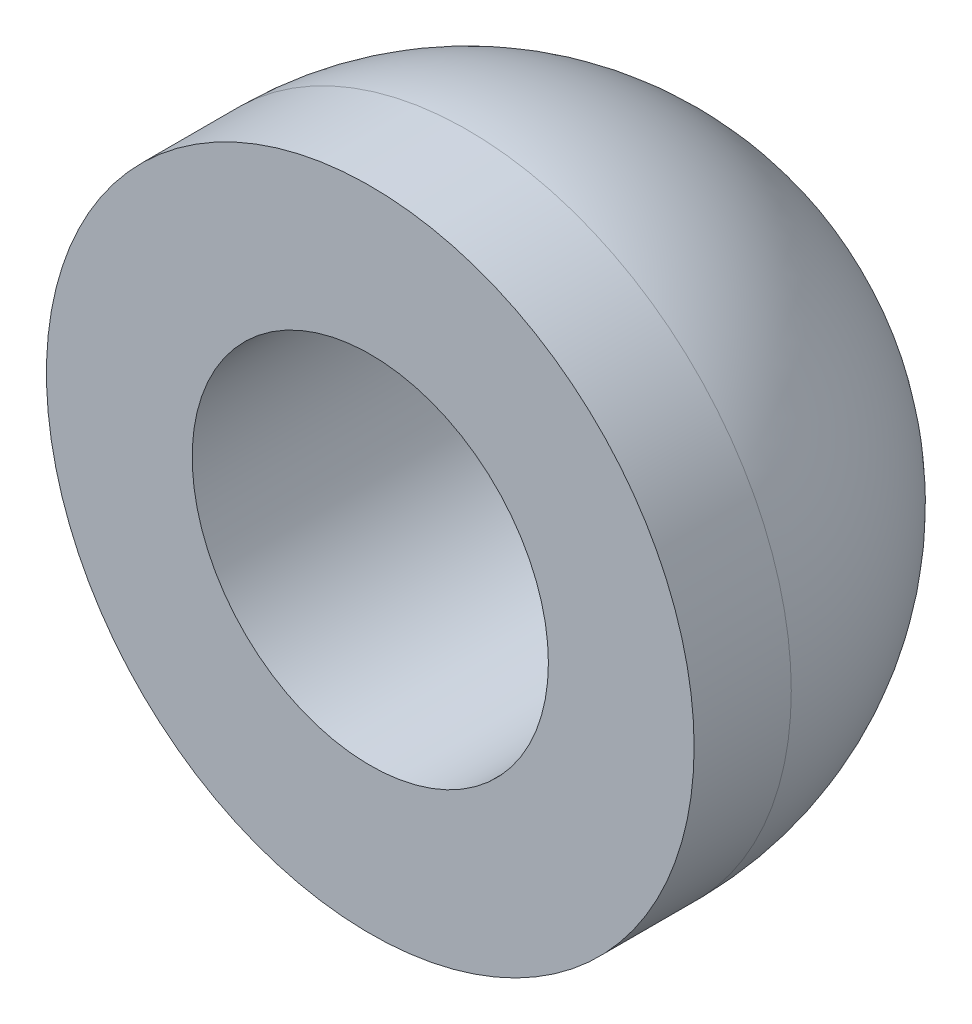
from build123d import *

# Parameters (mm, degrees)
ESQUISSE2_R             = 3.245703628
ENL_V_MAT_EXTRU_1_DEPTH = 1


with BuildPart() as part:
    # Esquisse1 → R_volution1 (revolve)
    with BuildSketch(Plane(origin=(0, 0, 0), x_dir=(0, 0, -1), z_dir=(1, 0, 0)), mode=Mode.PRIVATE) as r_volution1_sk:
        with BuildLine():
            Line((0, 2.75), (5.675823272, 2.75))
            ThreePointArc((5.675823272, 2.75), (3.871708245, 4.401704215), (1.5, 5))
            Line((1.5, 5), (0, 5))
            Line((0, 5), (0, 2.75))
        make_face()
    revolve(r_volution1_sk.sketch.rotate(Axis((0, 0, 0), (0, 0, -1)), 90), axis=Axis((0, 0, 0), (0, 0, -1)))

    # Esquisse2 → Enl_v. mat.-Extru.1 (cut)
    with BuildSketch(Plane.XY.offset(-5.5)):
        Circle(ESQUISSE2_R)
    extrude(amount=-ENL_V_MAT_EXTRU_1_DEPTH, mode=Mode.SUBTRACT)


solid = part.part
